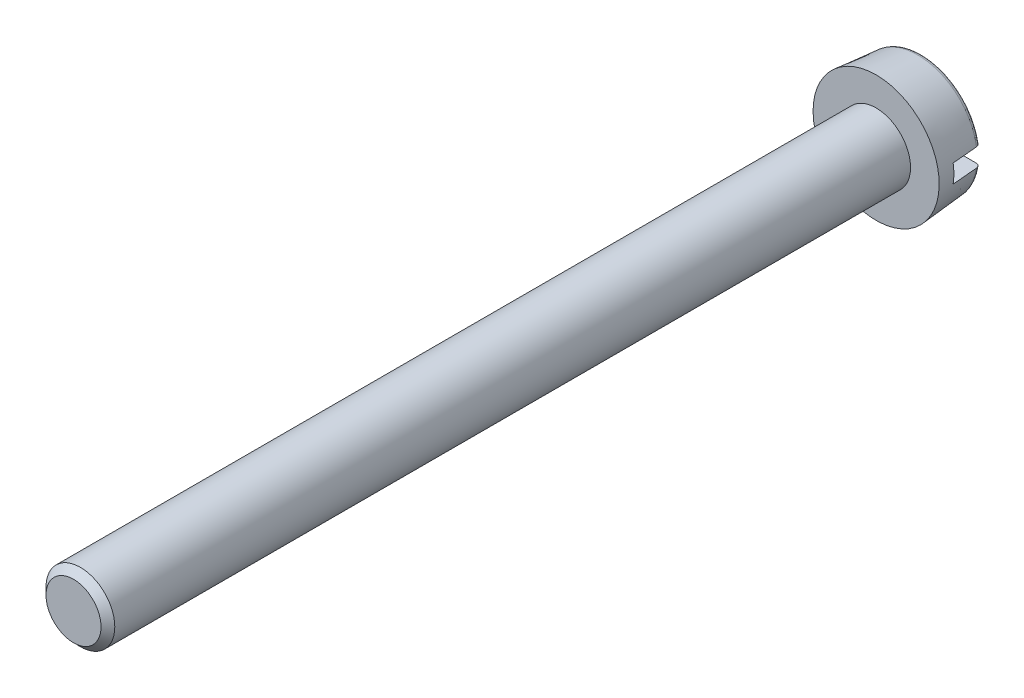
ISO-10303-21;
HEADER;
FILE_DESCRIPTION(('STEP AP214'),'2;1');
FILE_NAME('part.step','',(''),(''),'','','');
FILE_SCHEMA(('AUTOMOTIVE_DESIGN { 1 0 10303 214 1 1 1 1 }'));
ENDSEC;
DATA;
#1=APPLICATION_CONTEXT('core data for automotive mechanical design processes');
#2=APPLICATION_PROTOCOL_DEFINITION('international standard','automotive_design',2000,#1);
#3=PRODUCT_CONTEXT('',#1,'mechanical');
#4=PRODUCT('Part','Part','',(#3));
#5=PRODUCT_RELATED_PRODUCT_CATEGORY('part','',(#4));
#6=PRODUCT_DEFINITION_FORMATION('','',#4);
#7=PRODUCT_DEFINITION_CONTEXT('part definition',#1,'design');
#8=PRODUCT_DEFINITION('design','',#6,#7);
#9=PRODUCT_DEFINITION_SHAPE('','',#8);
#10=(LENGTH_UNIT() NAMED_UNIT(*) SI_UNIT(.MILLI.,.METRE.));
#11=(NAMED_UNIT(*) PLANE_ANGLE_UNIT() SI_UNIT($,.RADIAN.));
#12=(NAMED_UNIT(*) SI_UNIT($,.STERADIAN.) SOLID_ANGLE_UNIT());
#13=UNCERTAINTY_MEASURE_WITH_UNIT(LENGTH_MEASURE(1.E-05),#10,'distance_accuracy_value','');
#14=(GEOMETRIC_REPRESENTATION_CONTEXT(3) GLOBAL_UNCERTAINTY_ASSIGNED_CONTEXT((#13)) GLOBAL_UNIT_ASSIGNED_CONTEXT((#10,
#11,#12)) REPRESENTATION_CONTEXT('',''));
#15=CARTESIAN_POINT('',(0.,0.,0.));
#16=DIRECTION('',(0.,0.,1.));
#17=DIRECTION('',(1.,0.,0.));
#18=AXIS2_PLACEMENT_3D('',#15,#16,#17);
#19=CARTESIAN_POINT('',(0.,0.,-2.));
#20=DIRECTION('',(0.,0.,1.));
#21=DIRECTION('',(1.,0.,0.));
#22=AXIS2_PLACEMENT_3D('',#19,#20,#21);
#23=PLANE('',#22);
#24=DIRECTION('',(1.,0.,0.));
#25=VECTOR('',#24,1.);
#26=CARTESIAN_POINT('',(-2.75,-0.4,-2.));
#27=LINE('',#26,#25);
#28=CARTESIAN_POINT('',(-2.35807100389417,-0.4,-2.));
#29=VERTEX_POINT('',#28);
#30=CARTESIAN_POINT('',(2.35807100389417,-0.4,-2.));
#31=VERTEX_POINT('',#30);
#32=EDGE_CURVE('E210',#29,#31,#27,.T.);
#33=ORIENTED_EDGE('',*,*,#32,.T.);
#34=CARTESIAN_POINT('',(0.,0.,-2.));
#35=DIRECTION('',(0.,0.,-1.));
#36=DIRECTION('',(-1.,0.,0.));
#37=AXIS2_PLACEMENT_3D('',#34,#35,#36);
#38=CIRCLE('',#37,2.39175643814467);
#39=EDGE_CURVE('E112',#31,#29,#38,.T.);
#40=ORIENTED_EDGE('',*,*,#39,.T.);
#41=EDGE_LOOP('',(#33,#40));
#42=FACE_BOUND('',#41,.T.);
#43=ADVANCED_FACE('F32',(#42),#23,.F.);
#44=DIRECTION('',(-1.,0.,0.));
#45=VECTOR('',#44,1.);
#46=CARTESIAN_POINT('',(-2.75,0.4,-2.));
#47=LINE('',#46,#45);
#48=CARTESIAN_POINT('',(2.35807100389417,0.4,-2.));
#49=VERTEX_POINT('',#48);
#50=CARTESIAN_POINT('',(-2.35807100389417,0.4,-2.));
#51=VERTEX_POINT('',#50);
#52=EDGE_CURVE('E97',#49,#51,#47,.T.);
#53=ORIENTED_EDGE('',*,*,#52,.T.);
#54=EDGE_CURVE('E109',#51,#49,#38,.T.);
#55=ORIENTED_EDGE('',*,*,#54,.T.);
#56=EDGE_LOOP('',(#53,#55));
#57=FACE_BOUND('',#56,.T.);
#58=ADVANCED_FACE('F145',(#57),#23,.F.);
#59=CARTESIAN_POINT('',(0.,0.,-1.8));
#60=DIRECTION('',(0.,0.,-1.));
#61=DIRECTION('',(-1.,0.,0.));
#62=AXIS2_PLACEMENT_3D('',#59,#60,#61);
#63=TOROIDAL_SURFACE('',#62,2.39175643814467,0.2);
#64=CARTESIAN_POINT('',(-2.46056004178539,-0.4,-1.6274373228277));
#65=CARTESIAN_POINT('',(-2.47035713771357,-0.4,-1.63309189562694));
#66=CARTESIAN_POINT('',(-2.47967120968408,-0.4,-1.63958058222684));
#67=CARTESIAN_POINT('',(-2.49708617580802,-0.4,-1.65401697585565));
#68=CARTESIAN_POINT('',(-2.50518738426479,-0.4,-1.66196430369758));
#69=CARTESIAN_POINT('',(-2.51994054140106,-0.4,-1.67911855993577));
#70=CARTESIAN_POINT('',(-2.5265913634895,-0.4,-1.68832645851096));
#71=CARTESIAN_POINT('',(-2.53823475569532,-0.4,-1.70773274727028));
#72=CARTESIAN_POINT('',(-2.5432279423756,-0.4,-1.71793076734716));
#73=CARTESIAN_POINT('',(-2.55137056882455,-0.4,-1.73893734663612));
#74=CARTESIAN_POINT('',(-2.55453548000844,-0.4,-1.7497399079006));
#75=CARTESIAN_POINT('',(-2.55899152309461,-0.4,-1.77172702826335));
#76=CARTESIAN_POINT('',(-2.56028235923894,-0.4,-1.78291164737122));
#77=CARTESIAN_POINT('',(-2.56094692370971,-0.4,-1.80525009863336));
#78=CARTESIAN_POINT('',(-2.56033550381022,-0.4,-1.8164034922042));
#79=CARTESIAN_POINT('',(-2.55724668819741,-0.4,-1.83844701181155));
#80=CARTESIAN_POINT('',(-2.55476962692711,-0.4,-1.84933718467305));
#81=CARTESIAN_POINT('',(-2.54811803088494,-0.4,-1.87025531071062));
#82=CARTESIAN_POINT('',(-2.54399201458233,-0.4,-1.88029873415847));
#83=CARTESIAN_POINT('',(-2.53416340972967,-0.4,-1.89958227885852));
#84=CARTESIAN_POINT('',(-2.52846069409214,-0.4,-1.90882233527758));
#85=CARTESIAN_POINT('',(-2.51532195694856,-0.4,-1.92668639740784));
#86=CARTESIAN_POINT('',(-2.50781480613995,-0.4,-1.93525817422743));
#87=CARTESIAN_POINT('',(-2.49146359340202,-0.4,-1.9510149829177));
#88=CARTESIAN_POINT('',(-2.4826193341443,-0.4,-1.95819980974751));
#89=CARTESIAN_POINT('',(-2.46385856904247,-0.4,-1.9709840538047));
#90=CARTESIAN_POINT('',(-2.4539426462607,-0.4,-1.9765843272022));
#91=CARTESIAN_POINT('',(-2.43331831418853,-0.4,-1.98605791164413));
#92=CARTESIAN_POINT('',(-2.42260990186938,-0.4,-1.98993121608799));
#93=CARTESIAN_POINT('',(-2.40060009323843,-0.4,-1.99587983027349));
#94=CARTESIAN_POINT('',(-2.38929418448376,-0.4,-1.99793844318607));
#95=CARTESIAN_POINT('',(-2.36649726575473,-0.4,-2.00014639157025));
#96=CARTESIAN_POINT('',(-2.35500624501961,-0.4,-2.00029561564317));
#97=CARTESIAN_POINT('',(-2.33205956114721,-0.4,-1.99867602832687));
#98=CARTESIAN_POINT('',(-2.32060506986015,-0.4,-1.99689056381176));
#99=CARTESIAN_POINT('',(-2.298157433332,-0.4,-1.99142360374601));
#100=CARTESIAN_POINT('',(-2.28716429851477,-0.4,-1.98774206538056));
#101=CARTESIAN_POINT('',(-2.26594729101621,-0.4,-1.97857791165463));
#102=CARTESIAN_POINT('',(-2.25572391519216,-0.4,-1.97309414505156));
#103=CARTESIAN_POINT('',(-2.23635374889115,-0.4,-1.96047345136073));
#104=CARTESIAN_POINT('',(-2.22720691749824,-0.4,-1.95333658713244));
#105=CARTESIAN_POINT('',(-2.21034118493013,-0.4,-1.93767625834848));
#106=CARTESIAN_POINT('',(-2.20261024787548,-0.4,-1.92916576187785));
#107=CARTESIAN_POINT('',(-2.18871351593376,-0.4,-1.91095027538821));
#108=CARTESIAN_POINT('',(-2.18254759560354,-0.4,-1.90124538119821));
#109=CARTESIAN_POINT('',(-2.17205702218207,-0.4,-1.88107521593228));
#110=CARTESIAN_POINT('',(-2.16770567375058,-0.4,-1.8706238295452));
#111=CARTESIAN_POINT('',(-2.16084806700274,-0.4,-1.84913260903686));
#112=CARTESIAN_POINT('',(-2.15834160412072,-0.4,-1.83809284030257));
#113=CARTESIAN_POINT('',(-2.15527626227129,-0.4,-1.81590555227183));
#114=CARTESIAN_POINT('',(-2.15469036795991,-0.4,-1.80476175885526));
#115=CARTESIAN_POINT('',(-2.15540871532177,-0.4,-1.78253485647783));
#116=CARTESIAN_POINT('',(-2.1567129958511,-0.4,-1.77145174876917));
#117=CARTESIAN_POINT('',(-2.16115872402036,-0.4,-1.74972083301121));
#118=CARTESIAN_POINT('',(-2.16429062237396,-0.4,-1.73907106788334));
#119=CARTESIAN_POINT('',(-2.17228616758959,-0.4,-1.71844530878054));
#120=CARTESIAN_POINT('',(-2.17714955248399,-0.4,-1.70846921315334));
#121=CARTESIAN_POINT('',(-2.18849754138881,-0.4,-1.68940045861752));
#122=CARTESIAN_POINT('',(-2.19499228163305,-0.4,-1.6803138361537));
#123=CARTESIAN_POINT('',(-2.20939691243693,-0.4,-1.66333658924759));
#124=CARTESIAN_POINT('',(-2.21730736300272,-0.4,-1.65544644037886));
#125=CARTESIAN_POINT('',(-2.23443758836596,-0.4,-1.64097145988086));
#126=CARTESIAN_POINT('',(-2.24367438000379,-0.4,-1.6344067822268));
#127=CARTESIAN_POINT('',(-2.26310409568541,-0.4,-1.62288608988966));
#128=CARTESIAN_POINT('',(-2.27329719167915,-0.4,-1.61793036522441));
#129=CARTESIAN_POINT('',(-2.28383355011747,-0.4,-1.61386077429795));
#130=B_SPLINE_CURVE_WITH_KNOTS('',3,(#64,#65,#66,#67,#68,#69,#70,#71,#72,#73,#74,#75,#76,#77,
#78,#79,#80,#81,#82,#83,#84,#85,#86,#87,#88,#89,#90,#91,#92,#93,#94,#95,#96,#97,#98,#99,#100,
#101,#102,#103,#104,#105,#106,#107,#108,#109,#110,#111,#112,#113,#114,#115,#116,#117,#118,#119,
#120,#121,#122,#123,#124,#125,#126,#127,#128,#129),.UNSPECIFIED.,.F.,.F.,(4,2,2,2,2,2,2,2,2,2,2,
2,2,2,2,2,2,2,2,2,2,2,2,2,2,2,2,2,2,2,2,2,4),(0.,0.033894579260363,0.067780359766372,
0.101692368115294,0.135591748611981,0.16919989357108,0.202813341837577,0.236165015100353,
0.269510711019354,0.301940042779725,0.334371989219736,0.368390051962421,0.402413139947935,
0.436417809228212,0.470422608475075,0.504737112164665,0.539053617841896,0.573667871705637,
0.60828290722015,0.642920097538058,0.677555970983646,0.711882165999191,0.746205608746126,
0.780004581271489,0.813799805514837,0.847117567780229,0.880436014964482,0.913581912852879,
0.946722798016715,0.98007492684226,1.01344027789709,1.04728001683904,1.08112585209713),.UNSPECIFIED.);
#131=CARTESIAN_POINT('',(-2.55993301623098,-0.4,-1.81743114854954));
#132=VERTEX_POINT('',#131);
#133=EDGE_CURVE('E54',#29,#132,#130,.F.);
#134=ORIENTED_EDGE('',*,*,#133,.F.);
#135=ORIENTED_EDGE('',*,*,#39,.F.);
#136=CARTESIAN_POINT('',(2.26463348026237,-0.4,-1.62245170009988));
#137=CARTESIAN_POINT('',(2.25450054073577,-0.4,-1.62761569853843));
#138=CARTESIAN_POINT('',(2.24480752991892,-0.4,-1.63364077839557));
#139=CARTESIAN_POINT('',(2.22655983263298,-0.4,-1.64721950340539));
#140=CARTESIAN_POINT('',(2.21800507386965,-0.4,-1.65477305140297));
#141=CARTESIAN_POINT('',(2.20228447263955,-0.4,-1.67122264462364));
#142=CARTESIAN_POINT('',(2.1951197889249,-0.4,-1.68011979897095));
#143=CARTESIAN_POINT('',(2.18240904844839,-0.4,-1.69899889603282));
#144=CARTESIAN_POINT('',(2.17686229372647,-0.4,-1.70898036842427));
#145=CARTESIAN_POINT('',(2.16761264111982,-0.4,-1.7296271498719));
#146=CARTESIAN_POINT('',(2.16388939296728,-0.4,-1.74028333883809));
#147=CARTESIAN_POINT('',(2.15831063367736,-0.4,-1.76207632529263));
#148=CARTESIAN_POINT('',(2.15645538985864,-0.4,-1.77321319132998));
#149=CARTESIAN_POINT('',(2.15468535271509,-0.4,-1.79549349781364));
#150=CARTESIAN_POINT('',(2.15474560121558,-0.4,-1.80663496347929));
#151=CARTESIAN_POINT('',(2.15674287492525,-0.4,-1.82874600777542));
#152=CARTESIAN_POINT('',(2.15867941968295,-0.4,-1.83971562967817));
#153=CARTESIAN_POINT('',(2.16422713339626,-0.4,-1.86064578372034));
#154=CARTESIAN_POINT('',(2.16775159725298,-0.4,-1.87062942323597));
#155=CARTESIAN_POINT('',(2.17634210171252,-0.4,-1.88991007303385));
#156=CARTESIAN_POINT('',(2.18140828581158,-0.4,-1.89920701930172));
#157=CARTESIAN_POINT('',(2.19339026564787,-0.4,-1.917566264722));
#158=CARTESIAN_POINT('',(2.20041839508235,-0.4,-1.92655545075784));
#159=CARTESIAN_POINT('',(2.21588967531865,-0.4,-1.94322154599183));
#160=CARTESIAN_POINT('',(2.2243331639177,-0.4,-1.95089814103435));
#161=CARTESIAN_POINT('',(2.24237838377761,-0.4,-1.96472641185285));
#162=CARTESIAN_POINT('',(2.25197933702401,-0.4,-1.97087910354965));
#163=CARTESIAN_POINT('',(2.27206860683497,-0.4,-1.98150489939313));
#164=CARTESIAN_POINT('',(2.28255691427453,-0.4,-1.98597802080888));
#165=CARTESIAN_POINT('',(2.30424234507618,-0.4,-1.99316733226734));
#166=CARTESIAN_POINT('',(2.31544577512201,-0.4,-1.99586450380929));
#167=CARTESIAN_POINT('',(2.33814570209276,-0.4,-1.99935479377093));
#168=CARTESIAN_POINT('',(2.34964221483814,-0.4,-2.00014780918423));
#169=CARTESIAN_POINT('',(2.37268954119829,-0.4,-1.99980564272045));
#170=CARTESIAN_POINT('',(2.38424015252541,-0.4,-1.99865658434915));
#171=CARTESIAN_POINT('',(2.40698369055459,-0.4,-1.99443117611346));
#172=CARTESIAN_POINT('',(2.41817661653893,-0.4,-1.99135482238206));
#173=CARTESIAN_POINT('',(2.43985624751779,-0.4,-1.98336386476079));
#174=CARTESIAN_POINT('',(2.4503445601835,-0.4,-1.97845362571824));
#175=CARTESIAN_POINT('',(2.47033664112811,-0.4,-1.96692517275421));
#176=CARTESIAN_POINT('',(2.47984045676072,-0.4,-1.96030704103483));
#177=CARTESIAN_POINT('',(2.49749194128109,-0.4,-1.94561808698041));
#178=CARTESIAN_POINT('',(2.50565202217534,-0.4,-1.93756218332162));
#179=CARTESIAN_POINT('',(2.5204828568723,-0.4,-1.92017934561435));
#180=CARTESIAN_POINT('',(2.52715370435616,-0.4,-1.91085249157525));
#181=CARTESIAN_POINT('',(2.53872804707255,-0.4,-1.89131867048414));
#182=CARTESIAN_POINT('',(2.54365271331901,-0.4,-1.88112424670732));
#183=CARTESIAN_POINT('',(2.5517001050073,-0.4,-1.8600476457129));
#184=CARTESIAN_POINT('',(2.55482298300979,-0.4,-1.8491655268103));
#185=CARTESIAN_POINT('',(2.55914820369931,-0.4,-1.82714318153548));
#186=CARTESIAN_POINT('',(2.5603700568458,-0.4,-1.81600678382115));
#187=CARTESIAN_POINT('',(2.56091765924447,-0.4,-1.79368689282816));
#188=CARTESIAN_POINT('',(2.56024334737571,-0.4,-1.78250339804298));
#189=CARTESIAN_POINT('',(2.55702614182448,-0.4,-1.76045880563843));
#190=CARTESIAN_POINT('',(2.5544914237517,-0.4,-1.74959651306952));
#191=CARTESIAN_POINT('',(2.54763978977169,-0.4,-1.72845177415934));
#192=CARTESIAN_POINT('',(2.54332318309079,-0.4,-1.71816922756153));
#193=CARTESIAN_POINT('',(2.53302184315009,-0.4,-1.69844096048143));
#194=CARTESIAN_POINT('',(2.52703252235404,-0.4,-1.68899763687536));
#195=CARTESIAN_POINT('',(2.51356522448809,-0.4,-1.67123531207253));
#196=CARTESIAN_POINT('',(2.50608671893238,-0.4,-1.6629167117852));
#197=CARTESIAN_POINT('',(2.48978467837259,-0.4,-1.6475652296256));
#198=CARTESIAN_POINT('',(2.48094983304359,-0.4,-1.64054436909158));
#199=CARTESIAN_POINT('',(2.46224022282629,-0.4,-1.62805472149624));
#200=CARTESIAN_POINT('',(2.45236515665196,-0.4,-1.62258638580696));
#201=CARTESIAN_POINT('',(2.44210063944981,-0.4,-1.61798379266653));
#202=B_SPLINE_CURVE_WITH_KNOTS('',3,(#136,#137,#138,#139,#140,#141,#142,#143,#144,#145,#146,
#147,#148,#149,#150,#151,#152,#153,#154,#155,#156,#157,#158,#159,#160,#161,#162,#163,#164,#165,
#166,#167,#168,#169,#170,#171,#172,#173,#174,#175,#176,#177,#178,#179,#180,#181,#182,#183,#184,
#185,#186,#187,#188,#189,#190,#191,#192,#193,#194,#195,#196,#197,#198,#199,#200,#201),
.UNSPECIFIED.,.F.,.F.,(4,2,2,2,2,2,2,2,2,2,2,2,2,2,2,2,2,2,2,2,2,2,2,2,2,2,2,2,2,2,2,2,4),(0.,
0.0340784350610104,0.0681547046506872,0.102259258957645,0.136349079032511,0.170049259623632,
0.203754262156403,0.23702028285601,0.270277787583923,0.301905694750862,0.33353654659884,
0.367601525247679,0.401674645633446,0.435724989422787,0.469774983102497,0.504183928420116,
0.538594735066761,0.573252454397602,0.607910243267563,0.642486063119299,0.677060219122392,
0.711294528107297,0.745526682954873,0.779328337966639,0.813127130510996,0.846576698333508,
0.880027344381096,0.91333186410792,0.946630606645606,0.980021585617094,1.01342443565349,
1.04712269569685,1.08083074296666),.UNSPECIFIED.);
#203=CARTESIAN_POINT('',(2.55993301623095,-0.4,-1.81743114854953));
#204=VERTEX_POINT('',#203);
#205=EDGE_CURVE('E131',#204,#31,#202,.F.);
#206=ORIENTED_EDGE('',*,*,#205,.F.);
#207=CARTESIAN_POINT('',(0.,0.,-1.81743114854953));
#208=DIRECTION('',(0.,0.,-1.));
#209=DIRECTION('',(-1.,0.,0.));
#210=AXIS2_PLACEMENT_3D('',#207,#208,#209);
#211=CIRCLE('',#210,2.59099537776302);
#212=EDGE_CURVE('E121',#204,#132,#211,.T.);
#213=ORIENTED_EDGE('',*,*,#212,.T.);
#214=EDGE_LOOP('',(#134,#135,#206,#213));
#215=FACE_BOUND('',#214,.T.);
#216=ADVANCED_FACE('F140',(#215),#63,.T.);
#217=CARTESIAN_POINT('',(-2.46056004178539,0.4,-1.6274373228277));
#218=CARTESIAN_POINT('',(-2.47035713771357,0.4,-1.63309189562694));
#219=CARTESIAN_POINT('',(-2.47967120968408,0.4,-1.63958058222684));
#220=CARTESIAN_POINT('',(-2.49708617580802,0.4,-1.65401697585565));
#221=CARTESIAN_POINT('',(-2.50518738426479,0.4,-1.66196430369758));
#222=CARTESIAN_POINT('',(-2.51994054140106,0.4,-1.67911855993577));
#223=CARTESIAN_POINT('',(-2.5265913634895,0.4,-1.68832645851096));
#224=CARTESIAN_POINT('',(-2.53823475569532,0.4,-1.70773274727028));
#225=CARTESIAN_POINT('',(-2.5432279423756,0.4,-1.71793076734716));
#226=CARTESIAN_POINT('',(-2.55137056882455,0.4,-1.73893734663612));
#227=CARTESIAN_POINT('',(-2.55453548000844,0.4,-1.7497399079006));
#228=CARTESIAN_POINT('',(-2.55899152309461,0.4,-1.77172702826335));
#229=CARTESIAN_POINT('',(-2.56028235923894,0.4,-1.78291164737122));
#230=CARTESIAN_POINT('',(-2.56094692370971,0.4,-1.80525009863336));
#231=CARTESIAN_POINT('',(-2.56033550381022,0.4,-1.8164034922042));
#232=CARTESIAN_POINT('',(-2.55724668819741,0.4,-1.83844701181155));
#233=CARTESIAN_POINT('',(-2.55476962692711,0.4,-1.84933718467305));
#234=CARTESIAN_POINT('',(-2.54811803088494,0.4,-1.87025531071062));
#235=CARTESIAN_POINT('',(-2.54399201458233,0.4,-1.88029873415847));
#236=CARTESIAN_POINT('',(-2.53416340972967,0.4,-1.89958227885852));
#237=CARTESIAN_POINT('',(-2.52846069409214,0.4,-1.90882233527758));
#238=CARTESIAN_POINT('',(-2.51532195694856,0.4,-1.92668639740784));
#239=CARTESIAN_POINT('',(-2.50781480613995,0.4,-1.93525817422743));
#240=CARTESIAN_POINT('',(-2.49146359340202,0.4,-1.9510149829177));
#241=CARTESIAN_POINT('',(-2.4826193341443,0.4,-1.95819980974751));
#242=CARTESIAN_POINT('',(-2.46385856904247,0.4,-1.9709840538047));
#243=CARTESIAN_POINT('',(-2.4539426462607,0.4,-1.9765843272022));
#244=CARTESIAN_POINT('',(-2.43331831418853,0.4,-1.98605791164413));
#245=CARTESIAN_POINT('',(-2.42260990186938,0.4,-1.98993121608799));
#246=CARTESIAN_POINT('',(-2.40060009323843,0.4,-1.99587983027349));
#247=CARTESIAN_POINT('',(-2.38929418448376,0.4,-1.99793844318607));
#248=CARTESIAN_POINT('',(-2.36649726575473,0.4,-2.00014639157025));
#249=CARTESIAN_POINT('',(-2.35500624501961,0.4,-2.00029561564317));
#250=CARTESIAN_POINT('',(-2.33205956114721,0.4,-1.99867602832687));
#251=CARTESIAN_POINT('',(-2.32060506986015,0.4,-1.99689056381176));
#252=CARTESIAN_POINT('',(-2.298157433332,0.4,-1.99142360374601));
#253=CARTESIAN_POINT('',(-2.28716429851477,0.4,-1.98774206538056));
#254=CARTESIAN_POINT('',(-2.26594729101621,0.4,-1.97857791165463));
#255=CARTESIAN_POINT('',(-2.25572391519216,0.4,-1.97309414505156));
#256=CARTESIAN_POINT('',(-2.23635374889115,0.4,-1.96047345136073));
#257=CARTESIAN_POINT('',(-2.22720691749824,0.4,-1.95333658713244));
#258=CARTESIAN_POINT('',(-2.21034118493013,0.4,-1.93767625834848));
#259=CARTESIAN_POINT('',(-2.20261024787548,0.4,-1.92916576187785));
#260=CARTESIAN_POINT('',(-2.18871351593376,0.4,-1.91095027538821));
#261=CARTESIAN_POINT('',(-2.18254759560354,0.4,-1.90124538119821));
#262=CARTESIAN_POINT('',(-2.17205702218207,0.4,-1.88107521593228));
#263=CARTESIAN_POINT('',(-2.16770567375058,0.4,-1.8706238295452));
#264=CARTESIAN_POINT('',(-2.16084806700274,0.4,-1.84913260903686));
#265=CARTESIAN_POINT('',(-2.15834160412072,0.4,-1.83809284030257));
#266=CARTESIAN_POINT('',(-2.15527626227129,0.4,-1.81590555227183));
#267=CARTESIAN_POINT('',(-2.15469036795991,0.4,-1.80476175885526));
#268=CARTESIAN_POINT('',(-2.15540871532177,0.4,-1.78253485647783));
#269=CARTESIAN_POINT('',(-2.1567129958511,0.4,-1.77145174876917));
#270=CARTESIAN_POINT('',(-2.16115872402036,0.4,-1.74972083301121));
#271=CARTESIAN_POINT('',(-2.16429062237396,0.4,-1.73907106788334));
#272=CARTESIAN_POINT('',(-2.17228616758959,0.4,-1.71844530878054));
#273=CARTESIAN_POINT('',(-2.17714955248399,0.4,-1.70846921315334));
#274=CARTESIAN_POINT('',(-2.18849754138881,0.4,-1.68940045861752));
#275=CARTESIAN_POINT('',(-2.19499228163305,0.4,-1.6803138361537));
#276=CARTESIAN_POINT('',(-2.20939691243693,0.4,-1.66333658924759));
#277=CARTESIAN_POINT('',(-2.21730736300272,0.4,-1.65544644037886));
#278=CARTESIAN_POINT('',(-2.23443758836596,0.4,-1.64097145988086));
#279=CARTESIAN_POINT('',(-2.24367438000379,0.4,-1.6344067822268));
#280=CARTESIAN_POINT('',(-2.26310409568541,0.4,-1.62288608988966));
#281=CARTESIAN_POINT('',(-2.27329719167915,0.4,-1.61793036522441));
#282=CARTESIAN_POINT('',(-2.28383355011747,0.4,-1.61386077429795));
#283=B_SPLINE_CURVE_WITH_KNOTS('',3,(#217,#218,#219,#220,#221,#222,#223,#224,#225,#226,#227,
#228,#229,#230,#231,#232,#233,#234,#235,#236,#237,#238,#239,#240,#241,#242,#243,#244,#245,#246,
#247,#248,#249,#250,#251,#252,#253,#254,#255,#256,#257,#258,#259,#260,#261,#262,#263,#264,#265,
#266,#267,#268,#269,#270,#271,#272,#273,#274,#275,#276,#277,#278,#279,#280,#281,#282),
.UNSPECIFIED.,.F.,.F.,(4,2,2,2,2,2,2,2,2,2,2,2,2,2,2,2,2,2,2,2,2,2,2,2,2,2,2,2,2,2,2,2,4),(0.,
0.033894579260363,0.067780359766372,0.101692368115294,0.135591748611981,0.16919989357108,
0.202813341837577,0.236165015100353,0.269510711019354,0.301940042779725,0.334371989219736,
0.368390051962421,0.402413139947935,0.436417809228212,0.470422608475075,0.504737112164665,
0.539053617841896,0.573667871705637,0.60828290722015,0.642920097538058,0.677555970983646,
0.711882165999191,0.746205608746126,0.78000458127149,0.813799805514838,0.847117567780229,
0.880436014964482,0.913581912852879,0.946722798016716,0.98007492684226,1.01344027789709,
1.04728001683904,1.08112585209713),.UNSPECIFIED.);
#284=CARTESIAN_POINT('',(-2.55993301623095,0.4,-1.81743114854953));
#285=VERTEX_POINT('',#284);
#286=EDGE_CURVE('E158',#285,#51,#283,.T.);
#287=ORIENTED_EDGE('',*,*,#286,.F.);
#288=CARTESIAN_POINT('',(2.55993301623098,0.4,-1.81743114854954));
#289=VERTEX_POINT('',#288);
#290=EDGE_CURVE('E117',#285,#289,#211,.T.);
#291=ORIENTED_EDGE('',*,*,#290,.T.);
#292=CARTESIAN_POINT('',(2.26463348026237,0.4,-1.62245170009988));
#293=CARTESIAN_POINT('',(2.25450054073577,0.4,-1.62761569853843));
#294=CARTESIAN_POINT('',(2.24480752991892,0.4,-1.63364077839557));
#295=CARTESIAN_POINT('',(2.22655983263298,0.4,-1.64721950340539));
#296=CARTESIAN_POINT('',(2.21800507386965,0.4,-1.65477305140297));
#297=CARTESIAN_POINT('',(2.20228447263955,0.4,-1.67122264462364));
#298=CARTESIAN_POINT('',(2.1951197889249,0.4,-1.68011979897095));
#299=CARTESIAN_POINT('',(2.18240904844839,0.4,-1.69899889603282));
#300=CARTESIAN_POINT('',(2.17686229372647,0.4,-1.70898036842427));
#301=CARTESIAN_POINT('',(2.16761264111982,0.4,-1.7296271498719));
#302=CARTESIAN_POINT('',(2.16388939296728,0.4,-1.74028333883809));
#303=CARTESIAN_POINT('',(2.15831063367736,0.4,-1.76207632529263));
#304=CARTESIAN_POINT('',(2.15645538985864,0.4,-1.77321319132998));
#305=CARTESIAN_POINT('',(2.15468535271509,0.4,-1.79549349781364));
#306=CARTESIAN_POINT('',(2.15474560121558,0.4,-1.80663496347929));
#307=CARTESIAN_POINT('',(2.15674287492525,0.4,-1.82874600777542));
#308=CARTESIAN_POINT('',(2.15867941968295,0.4,-1.83971562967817));
#309=CARTESIAN_POINT('',(2.16422713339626,0.4,-1.86064578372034));
#310=CARTESIAN_POINT('',(2.16775159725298,0.4,-1.87062942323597));
#311=CARTESIAN_POINT('',(2.17634210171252,0.4,-1.88991007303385));
#312=CARTESIAN_POINT('',(2.18140828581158,0.4,-1.89920701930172));
#313=CARTESIAN_POINT('',(2.19339026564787,0.4,-1.917566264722));
#314=CARTESIAN_POINT('',(2.20041839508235,0.4,-1.92655545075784));
#315=CARTESIAN_POINT('',(2.21588967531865,0.4,-1.94322154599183));
#316=CARTESIAN_POINT('',(2.2243331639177,0.4,-1.95089814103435));
#317=CARTESIAN_POINT('',(2.24237838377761,0.4,-1.96472641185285));
#318=CARTESIAN_POINT('',(2.25197933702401,0.4,-1.97087910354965));
#319=CARTESIAN_POINT('',(2.27206860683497,0.4,-1.98150489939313));
#320=CARTESIAN_POINT('',(2.28255691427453,0.4,-1.98597802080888));
#321=CARTESIAN_POINT('',(2.30424234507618,0.4,-1.99316733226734));
#322=CARTESIAN_POINT('',(2.31544577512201,0.4,-1.99586450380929));
#323=CARTESIAN_POINT('',(2.33814570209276,0.4,-1.99935479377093));
#324=CARTESIAN_POINT('',(2.34964221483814,0.4,-2.00014780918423));
#325=CARTESIAN_POINT('',(2.37268954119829,0.4,-1.99980564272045));
#326=CARTESIAN_POINT('',(2.38424015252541,0.4,-1.99865658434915));
#327=CARTESIAN_POINT('',(2.40698369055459,0.4,-1.99443117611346));
#328=CARTESIAN_POINT('',(2.41817661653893,0.4,-1.99135482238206));
#329=CARTESIAN_POINT('',(2.43985624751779,0.4,-1.98336386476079));
#330=CARTESIAN_POINT('',(2.4503445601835,0.4,-1.97845362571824));
#331=CARTESIAN_POINT('',(2.47033664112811,0.4,-1.96692517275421));
#332=CARTESIAN_POINT('',(2.47984045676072,0.4,-1.96030704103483));
#333=CARTESIAN_POINT('',(2.49749194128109,0.4,-1.94561808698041));
#334=CARTESIAN_POINT('',(2.50565202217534,0.4,-1.93756218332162));
#335=CARTESIAN_POINT('',(2.5204828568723,0.4,-1.92017934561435));
#336=CARTESIAN_POINT('',(2.52715370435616,0.4,-1.91085249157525));
#337=CARTESIAN_POINT('',(2.53872804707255,0.4,-1.89131867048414));
#338=CARTESIAN_POINT('',(2.54365271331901,0.4,-1.88112424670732));
#339=CARTESIAN_POINT('',(2.5517001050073,0.4,-1.8600476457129));
#340=CARTESIAN_POINT('',(2.55482298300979,0.4,-1.8491655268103));
#341=CARTESIAN_POINT('',(2.55914820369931,0.4,-1.82714318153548));
#342=CARTESIAN_POINT('',(2.5603700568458,0.4,-1.81600678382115));
#343=CARTESIAN_POINT('',(2.56091765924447,0.4,-1.79368689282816));
#344=CARTESIAN_POINT('',(2.56024334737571,0.4,-1.78250339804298));
#345=CARTESIAN_POINT('',(2.55702614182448,0.4,-1.76045880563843));
#346=CARTESIAN_POINT('',(2.5544914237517,0.4,-1.74959651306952));
#347=CARTESIAN_POINT('',(2.54763978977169,0.4,-1.72845177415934));
#348=CARTESIAN_POINT('',(2.54332318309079,0.4,-1.71816922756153));
#349=CARTESIAN_POINT('',(2.53302184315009,0.4,-1.69844096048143));
#350=CARTESIAN_POINT('',(2.52703252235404,0.4,-1.68899763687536));
#351=CARTESIAN_POINT('',(2.51356522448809,0.4,-1.67123531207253));
#352=CARTESIAN_POINT('',(2.50608671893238,0.4,-1.6629167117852));
#353=CARTESIAN_POINT('',(2.48978467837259,0.4,-1.6475652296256));
#354=CARTESIAN_POINT('',(2.48094983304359,0.4,-1.64054436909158));
#355=CARTESIAN_POINT('',(2.46224022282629,0.4,-1.62805472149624));
#356=CARTESIAN_POINT('',(2.45236515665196,0.4,-1.62258638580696));
#357=CARTESIAN_POINT('',(2.44210063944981,0.4,-1.61798379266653));
#358=B_SPLINE_CURVE_WITH_KNOTS('',3,(#292,#293,#294,#295,#296,#297,#298,#299,#300,#301,#302,
#303,#304,#305,#306,#307,#308,#309,#310,#311,#312,#313,#314,#315,#316,#317,#318,#319,#320,#321,
#322,#323,#324,#325,#326,#327,#328,#329,#330,#331,#332,#333,#334,#335,#336,#337,#338,#339,#340,
#341,#342,#343,#344,#345,#346,#347,#348,#349,#350,#351,#352,#353,#354,#355,#356,#357),
.UNSPECIFIED.,.F.,.F.,(4,2,2,2,2,2,2,2,2,2,2,2,2,2,2,2,2,2,2,2,2,2,2,2,2,2,2,2,2,2,2,2,4),(0.,
0.0340784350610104,0.0681547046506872,0.102259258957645,0.136349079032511,0.170049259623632,
0.203754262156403,0.23702028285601,0.270277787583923,0.301905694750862,0.33353654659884,
0.367601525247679,0.401674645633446,0.435724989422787,0.469774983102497,0.504183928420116,
0.538594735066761,0.573252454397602,0.607910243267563,0.642486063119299,0.677060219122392,
0.711294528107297,0.745526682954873,0.779328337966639,0.813127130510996,0.846576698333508,
0.880027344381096,0.91333186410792,0.946630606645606,0.980021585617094,1.01342443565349,
1.04712269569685,1.08083074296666),.UNSPECIFIED.);
#359=EDGE_CURVE('E151',#49,#289,#358,.T.);
#360=ORIENTED_EDGE('',*,*,#359,.F.);
#361=ORIENTED_EDGE('',*,*,#54,.F.);
#362=EDGE_LOOP('',(#287,#291,#360,#361));
#363=FACE_BOUND('',#362,.T.);
#364=ADVANCED_FACE('F144',(#363),#63,.T.);
#365=CARTESIAN_POINT('',(0.,0.,0.));
#366=DIRECTION('',(0.,0.,1.));
#367=DIRECTION('',(1.,0.,0.));
#368=AXIS2_PLACEMENT_3D('',#365,#366,#367);
#369=CONICAL_SURFACE('',#368,2.75,0.0872664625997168);
#370=CARTESIAN_POINT('',(0.,0.,0.));
#371=DIRECTION('',(0.,0.,-1.));
#372=DIRECTION('',(-1.,0.,0.));
#373=AXIS2_PLACEMENT_3D('',#370,#371,#372);
#374=CIRCLE('',#373,2.75);
#375=CARTESIAN_POINT('',(-2.75,0.,0.));
#376=VERTEX_POINT('',#375);
#377=EDGE_CURVE('E122',#376,#376,#374,.T.);
#378=ORIENTED_EDGE('',*,*,#377,.T.);
#379=EDGE_LOOP('',(#378));
#380=FACE_BOUND('',#379,.T.);
#381=CARTESIAN_POINT('',(-2.17665154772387,-0.4,-6.13679417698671));
#382=CARTESIAN_POINT('',(-2.29688458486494,-0.4,-4.78501127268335));
#383=CARTESIAN_POINT('',(-2.41682603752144,-0.4,-3.43320249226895));
#384=CARTESIAN_POINT('',(-2.55941857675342,-0.4,-1.82327092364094));
#385=CARTESIAN_POINT('',(-2.5822713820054,-0.4,-1.56516600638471));
#386=CARTESIAN_POINT('',(-2.74761802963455,-0.4,0.302879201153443));
#387=CARTESIAN_POINT('',(-2.88984427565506,-0.4,1.91284318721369));
#388=CARTESIAN_POINT('',(-3.03193476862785,-0.4,3.52281911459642));
#389=B_SPLINE_CURVE_WITH_KNOTS('',3,(#381,#382,#383,#384,#385,#386,#387,#388),.UNSPECIFIED.,.F.,
.F.,(4,2,2,4),(0.,4.07135801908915,4.84870195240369,9.69740384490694),.UNSPECIFIED.);
#390=CARTESIAN_POINT('',(-2.65883794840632,-0.4,-0.7));
#391=VERTEX_POINT('',#390);
#392=EDGE_CURVE('E82',#132,#391,#389,.T.);
#393=ORIENTED_EDGE('',*,*,#392,.F.);
#394=ORIENTED_EDGE('',*,*,#212,.F.);
#395=CARTESIAN_POINT('',(3.03193476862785,-0.4,3.52281911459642));
#396=CARTESIAN_POINT('',(2.96089605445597,-0.4,2.71783055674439));
#397=CARTESIAN_POINT('',(2.88981709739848,-0.4,1.9128455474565));
#398=CARTESIAN_POINT('',(2.74755308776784,-0.4,0.302884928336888));
#399=CARTESIAN_POINT('',(2.6763680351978,-0.4,-0.502090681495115));
#400=CARTESIAN_POINT('',(2.53386621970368,-0.4,-2.11203025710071));
#401=CARTESIAN_POINT('',(2.46254945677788,-0.4,-2.91699422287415));
#402=CARTESIAN_POINT('',(2.31974175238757,-0.4,-4.52690672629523));
#403=CARTESIAN_POINT('',(2.24825081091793,-0.4,-5.33185526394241));
#404=CARTESIAN_POINT('',(2.17665154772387,-0.4,-6.13679417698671));
#405=B_SPLINE_CURVE_WITH_KNOTS('',3,(#395,#396,#397,#398,#399,#400,#401,#402,#403,#404),
.UNSPECIFIED.,.F.,.F.,(4,2,2,2,4),(0.,2.42435098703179,4.84870190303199,7.27305285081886,
9.69740387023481),.UNSPECIFIED.);
#406=CARTESIAN_POINT('',(2.65883794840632,-0.4,-0.7));
#407=VERTEX_POINT('',#406);
#408=EDGE_CURVE('E102',#407,#204,#405,.T.);
#409=ORIENTED_EDGE('',*,*,#408,.F.);
#410=CARTESIAN_POINT('',(0.,0.,-0.7));
#411=DIRECTION('',(0.,0.,1.));
#412=DIRECTION('',(1.,0.,0.));
#413=AXIS2_PLACEMENT_3D('',#410,#411,#412);
#414=CIRCLE('',#413,2.68875793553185);
#415=CARTESIAN_POINT('',(2.65883794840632,0.4,-0.7));
#416=VERTEX_POINT('',#415);
#417=EDGE_CURVE('E96',#407,#416,#414,.T.);
#418=ORIENTED_EDGE('',*,*,#417,.T.);
#419=CARTESIAN_POINT('',(2.17665154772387,0.4,-6.13679417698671));
#420=CARTESIAN_POINT('',(2.29688458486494,0.4,-4.78501127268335));
#421=CARTESIAN_POINT('',(2.41682603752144,0.4,-3.43320249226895));
#422=CARTESIAN_POINT('',(2.55941857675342,0.4,-1.82327092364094));
#423=CARTESIAN_POINT('',(2.5822713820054,0.4,-1.56516600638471));
#424=CARTESIAN_POINT('',(2.74761802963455,0.4,0.302879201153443));
#425=CARTESIAN_POINT('',(2.88984427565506,0.4,1.91284318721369));
#426=CARTESIAN_POINT('',(3.03193476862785,0.4,3.52281911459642));
#427=B_SPLINE_CURVE_WITH_KNOTS('',3,(#419,#420,#421,#422,#423,#424,#425,#426),.UNSPECIFIED.,.F.,
.F.,(4,2,2,4),(0.,4.07135801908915,4.84870195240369,9.69740384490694),.UNSPECIFIED.);
#428=EDGE_CURVE('E105',#289,#416,#427,.T.);
#429=ORIENTED_EDGE('',*,*,#428,.F.);
#430=ORIENTED_EDGE('',*,*,#290,.F.);
#431=CARTESIAN_POINT('',(-3.03193476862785,0.4,3.52281911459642));
#432=CARTESIAN_POINT('',(-2.96089605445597,0.4,2.71783055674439));
#433=CARTESIAN_POINT('',(-2.88981709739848,0.4,1.9128455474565));
#434=CARTESIAN_POINT('',(-2.74755308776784,0.4,0.302884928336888));
#435=CARTESIAN_POINT('',(-2.6763680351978,0.4,-0.502090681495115));
#436=CARTESIAN_POINT('',(-2.53386621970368,0.4,-2.11203025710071));
#437=CARTESIAN_POINT('',(-2.46254945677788,0.4,-2.91699422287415));
#438=CARTESIAN_POINT('',(-2.31974175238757,0.4,-4.52690672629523));
#439=CARTESIAN_POINT('',(-2.24825081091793,0.4,-5.33185526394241));
#440=CARTESIAN_POINT('',(-2.17665154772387,0.4,-6.13679417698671));
#441=B_SPLINE_CURVE_WITH_KNOTS('',3,(#431,#432,#433,#434,#435,#436,#437,#438,#439,#440),
.UNSPECIFIED.,.F.,.F.,(4,2,2,2,4),(0.,2.42435098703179,4.84870190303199,7.27305285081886,
9.69740387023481),.UNSPECIFIED.);
#442=CARTESIAN_POINT('',(-2.65883794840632,0.4,-0.7));
#443=VERTEX_POINT('',#442);
#444=EDGE_CURVE('E91',#443,#285,#441,.T.);
#445=ORIENTED_EDGE('',*,*,#444,.F.);
#446=EDGE_CURVE('E94',#443,#391,#414,.T.);
#447=ORIENTED_EDGE('',*,*,#446,.T.);
#448=EDGE_LOOP('',(#393,#394,#409,#418,#429,#430,#445,#447));
#449=FACE_BOUND('',#448,.T.);
#450=ADVANCED_FACE('F100',(#380,#449),#369,.T.);
#451=CARTESIAN_POINT('',(0.,0.,0.));
#452=DIRECTION('',(0.,0.,-1.));
#453=DIRECTION('',(-1.,0.,0.));
#454=AXIS2_PLACEMENT_3D('',#451,#452,#453);
#455=PLANE('',#454);
#456=CARTESIAN_POINT('',(0.,0.,0.));
#457=DIRECTION('',(0.,0.,1.));
#458=DIRECTION('',(1.,0.,0.));
#459=AXIS2_PLACEMENT_3D('',#456,#457,#458);
#460=CIRCLE('',#459,1.5);
#461=CARTESIAN_POINT('',(1.5,0.,0.));
#462=VERTEX_POINT('',#461);
#463=EDGE_CURVE('E212',#462,#462,#460,.T.);
#464=ORIENTED_EDGE('',*,*,#463,.F.);
#465=EDGE_LOOP('',(#464));
#466=FACE_BOUND('',#465,.T.);
#467=ORIENTED_EDGE('',*,*,#377,.F.);
#468=EDGE_LOOP('',(#467));
#469=FACE_BOUND('',#468,.T.);
#470=ADVANCED_FACE('F225',(#466,#469),#455,.F.);
#471=CARTESIAN_POINT('',(-2.75,-0.4,-0.7));
#472=DIRECTION('',(0.,1.,0.));
#473=DIRECTION('',(0.,0.,1.));
#474=AXIS2_PLACEMENT_3D('',#471,#472,#473);
#475=PLANE('',#474);
#476=ORIENTED_EDGE('',*,*,#133,.T.);
#477=ORIENTED_EDGE('',*,*,#392,.T.);
#478=DIRECTION('',(1.,0.,0.));
#479=VECTOR('',#478,1.);
#480=CARTESIAN_POINT('',(-2.75,-0.4,-0.7));
#481=LINE('',#480,#479);
#482=EDGE_CURVE('E85',#391,#407,#481,.T.);
#483=ORIENTED_EDGE('',*,*,#482,.T.);
#484=ORIENTED_EDGE('',*,*,#408,.T.);
#485=ORIENTED_EDGE('',*,*,#205,.T.);
#486=ORIENTED_EDGE('',*,*,#32,.F.);
#487=EDGE_LOOP('',(#476,#477,#483,#484,#485,#486));
#488=FACE_BOUND('',#487,.T.);
#489=ADVANCED_FACE('F84',(#488),#475,.T.);
#490=CARTESIAN_POINT('',(-2.75,0.4,-0.7));
#491=DIRECTION('',(0.,-1.,0.));
#492=DIRECTION('',(0.,0.,-1.));
#493=AXIS2_PLACEMENT_3D('',#490,#491,#492);
#494=PLANE('',#493);
#495=ORIENTED_EDGE('',*,*,#286,.T.);
#496=ORIENTED_EDGE('',*,*,#52,.F.);
#497=ORIENTED_EDGE('',*,*,#359,.T.);
#498=ORIENTED_EDGE('',*,*,#428,.T.);
#499=DIRECTION('',(-1.,0.,0.));
#500=VECTOR('',#499,1.);
#501=CARTESIAN_POINT('',(-2.75,0.4,-0.7));
#502=LINE('',#501,#500);
#503=EDGE_CURVE('E46',#416,#443,#502,.T.);
#504=ORIENTED_EDGE('',*,*,#503,.T.);
#505=ORIENTED_EDGE('',*,*,#444,.T.);
#506=EDGE_LOOP('',(#495,#496,#497,#498,#504,#505));
#507=FACE_BOUND('',#506,.T.);
#508=ADVANCED_FACE('F163',(#507),#494,.T.);
#509=CARTESIAN_POINT('',(-2.75,-0.4,-0.7));
#510=DIRECTION('',(0.,0.,1.));
#511=DIRECTION('',(1.,0.,0.));
#512=AXIS2_PLACEMENT_3D('',#509,#510,#511);
#513=PLANE('',#512);
#514=ORIENTED_EDGE('',*,*,#503,.F.);
#515=ORIENTED_EDGE('',*,*,#417,.F.);
#516=ORIENTED_EDGE('',*,*,#482,.F.);
#517=ORIENTED_EDGE('',*,*,#446,.F.);
#518=EDGE_LOOP('',(#514,#515,#516,#517));
#519=FACE_BOUND('',#518,.T.);
#520=ADVANCED_FACE('F93',(#519),#513,.F.);
#521=CARTESIAN_POINT('',(0.,0.,35.));
#522=DIRECTION('',(0.,0.,1.));
#523=DIRECTION('',(1.,0.,0.));
#524=AXIS2_PLACEMENT_3D('',#521,#522,#523);
#525=PLANE('',#524);
#526=CARTESIAN_POINT('',(0.,0.,35.));
#527=DIRECTION('',(0.,0.,1.));
#528=DIRECTION('',(1.,0.,0.));
#529=AXIS2_PLACEMENT_3D('',#526,#527,#528);
#530=CIRCLE('',#529,1.19999999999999);
#531=CARTESIAN_POINT('',(1.2,0.,35.));
#532=VERTEX_POINT('',#531);
#533=EDGE_CURVE('E39',#532,#532,#530,.T.);
#534=ORIENTED_EDGE('',*,*,#533,.T.);
#535=EDGE_LOOP('',(#534));
#536=FACE_BOUND('',#535,.T.);
#537=ADVANCED_FACE('F191',(#536),#525,.T.);
#538=CARTESIAN_POINT('',(0.,0.,0.));
#539=DIRECTION('',(0.,0.,1.));
#540=DIRECTION('',(1.,0.,0.));
#541=AXIS2_PLACEMENT_3D('',#538,#539,#540);
#542=CYLINDRICAL_SURFACE('',#541,1.5);
#543=CARTESIAN_POINT('',(0.,0.,34.7));
#544=DIRECTION('',(0.,0.,1.));
#545=DIRECTION('',(1.,0.,0.));
#546=AXIS2_PLACEMENT_3D('',#543,#544,#545);
#547=CIRCLE('',#546,1.5);
#548=CARTESIAN_POINT('',(1.5,0.,34.7));
#549=VERTEX_POINT('',#548);
#550=EDGE_CURVE('E11',#549,#549,#547,.F.);
#551=ORIENTED_EDGE('',*,*,#550,.T.);
#552=EDGE_LOOP('',(#551));
#553=FACE_BOUND('',#552,.T.);
#554=ORIENTED_EDGE('',*,*,#463,.T.);
#555=EDGE_LOOP('',(#554));
#556=FACE_BOUND('',#555,.T.);
#557=ADVANCED_FACE('F195',(#553,#556),#542,.T.);
#558=CARTESIAN_POINT('',(0.,0.,35.));
#559=DIRECTION('',(0.,0.,-1.));
#560=DIRECTION('',(-1.,0.,0.));
#561=AXIS2_PLACEMENT_3D('',#558,#559,#560);
#562=CONICAL_SURFACE('',#561,1.19999999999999,0.785398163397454);
#563=ORIENTED_EDGE('',*,*,#550,.F.);
#564=EDGE_LOOP('',(#563));
#565=FACE_BOUND('',#564,.T.);
#566=ORIENTED_EDGE('',*,*,#533,.F.);
#567=EDGE_LOOP('',(#566));
#568=FACE_BOUND('',#567,.T.);
#569=ADVANCED_FACE('F193',(#565,#568),#562,.T.);
#570=CLOSED_SHELL('',(#43,#58,#216,#364,#450,#470,#489,#508,#520,#537,#557,#569));
#571=MANIFOLD_SOLID_BREP('B2',#570);
#572=ADVANCED_BREP_SHAPE_REPRESENTATION('',(#18,#571),#14);
#573=SHAPE_DEFINITION_REPRESENTATION(#9,#572);
ENDSEC;
END-ISO-10303-21;
